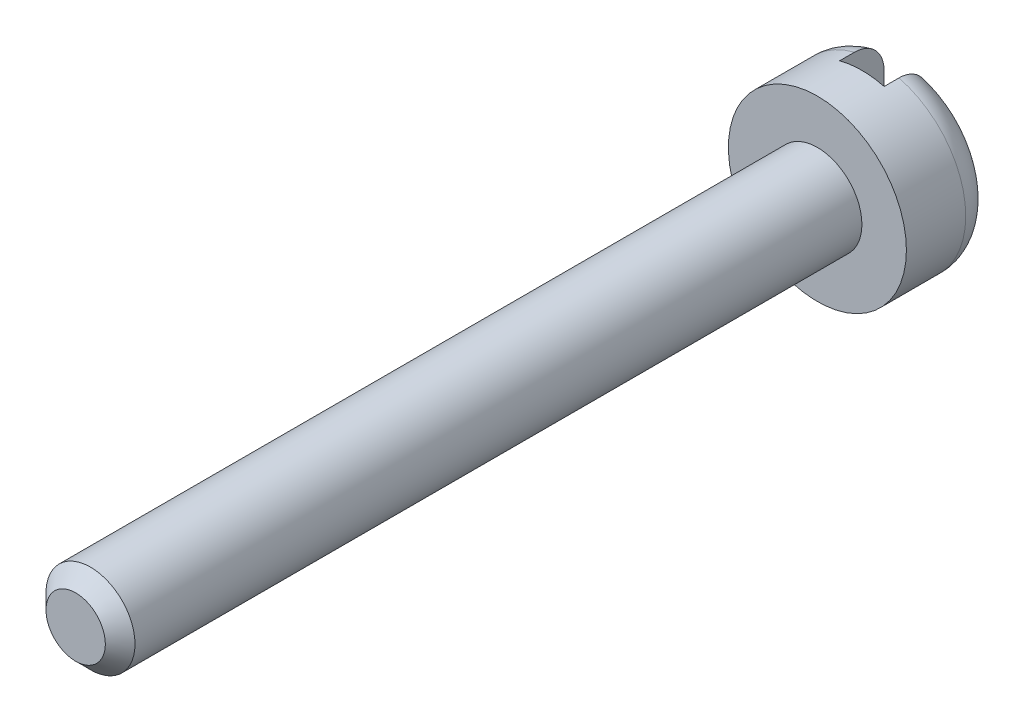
from build123d import *

# Parameters (mm, degrees)
ESQUISSE1_R             = 3
BASE_EXTRUSION_DEPTH    = 3
ESQUISSE2_W             = 1.5
ESQUISSE2_H             = 1.5
ENL_V_MAT_EXTRU_1_DEPTH = 23
ESQUISSE3_W             = 1.5
ESQUISSE3_H             = 1.5
ENL_V_MAT_EXTRU_2_DEPTH = 23
ESQUISSE4_R             = 1.5
BOSS_EXTRU_1_DEPTH      = 25
CHANFREIN1_SIZE         = 0.5
CONG_1_R                = 1


with BuildPart() as part:
    # Esquisse1 → Base-Extrusion (new body)
    with BuildSketch(Plane.XY):
        with Locations(Location((0, 0, 0), (0, 0, 104.477512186))):
            Circle(ESQUISSE1_R)
    extrude(amount=BASE_EXTRUSION_DEPTH)

    # Esquisse2 → Enl_v. mat.-Extru.1 (cut)
    with BuildSketch(Plane(origin=(0, 0, 0), x_dir=(1, 0, 0), z_dir=(0, 1, 0))):
        with Locations((0, -0.75)):
            Rectangle(ESQUISSE2_W, ESQUISSE2_H)
    extrude(amount=-ENL_V_MAT_EXTRU_1_DEPTH, mode=Mode.SUBTRACT)

    # Esquisse3 → Enl_v. mat.-Extru.2 (cut)
    with BuildSketch(Plane.XZ):
        with Locations((0, 0.75)):
            Rectangle(ESQUISSE3_W, ESQUISSE3_H)
    extrude(amount=-ENL_V_MAT_EXTRU_2_DEPTH, mode=Mode.SUBTRACT)

    # Esquisse4 → Boss.-Extru.1 (add)
    with BuildSketch(Plane.XY.offset(3)):
        Circle(ESQUISSE4_R)
    extrude(amount=BOSS_EXTRU_1_DEPTH)

    # Chanfrein1
    chanfrein1_edges = [part.edges().sort_by_distance(p)[0] for p in [
        (-1.5, 0, 28),
    ]]
    chamfer(chanfrein1_edges, length=CHANFREIN1_SIZE)

    # Cong_1
    cong_1_edges = [part.edges().sort_by_distance(p)[0] for p in [
        (-3, 0, 0),
        (3, 0, 0),
    ]]
    fillet(cong_1_edges, radius=CONG_1_R)


solid = part.part
